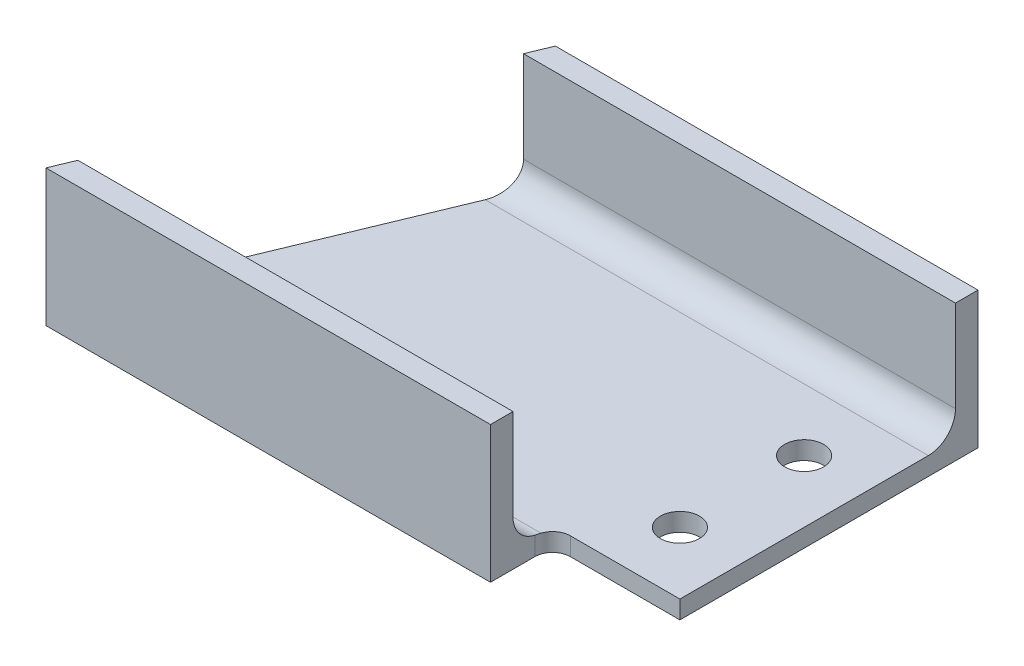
ISO-10303-21;
HEADER;
FILE_DESCRIPTION(('STEP AP214'),'2;1');
FILE_NAME('part.step','',(''),(''),'','','');
FILE_SCHEMA(('AUTOMOTIVE_DESIGN { 1 0 10303 214 1 1 1 1 }'));
ENDSEC;
DATA;
#1=APPLICATION_CONTEXT('core data for automotive mechanical design processes');
#2=APPLICATION_PROTOCOL_DEFINITION('international standard','automotive_design',2000,#1);
#3=PRODUCT_CONTEXT('',#1,'mechanical');
#4=PRODUCT('Part','Part','',(#3));
#5=PRODUCT_RELATED_PRODUCT_CATEGORY('part','',(#4));
#6=PRODUCT_DEFINITION_FORMATION('','',#4);
#7=PRODUCT_DEFINITION_CONTEXT('part definition',#1,'design');
#8=PRODUCT_DEFINITION('design','',#6,#7);
#9=PRODUCT_DEFINITION_SHAPE('','',#8);
#10=(LENGTH_UNIT() NAMED_UNIT(*) SI_UNIT(.MILLI.,.METRE.));
#11=(NAMED_UNIT(*) PLANE_ANGLE_UNIT() SI_UNIT($,.RADIAN.));
#12=(NAMED_UNIT(*) SI_UNIT($,.STERADIAN.) SOLID_ANGLE_UNIT());
#13=UNCERTAINTY_MEASURE_WITH_UNIT(LENGTH_MEASURE(1.E-05),#10,'distance_accuracy_value','');
#14=(GEOMETRIC_REPRESENTATION_CONTEXT(3) GLOBAL_UNCERTAINTY_ASSIGNED_CONTEXT((#13)) GLOBAL_UNIT_ASSIGNED_CONTEXT((#10,
#11,#12)) REPRESENTATION_CONTEXT('',''));
#15=CARTESIAN_POINT('',(0.,0.,0.));
#16=DIRECTION('',(0.,0.,1.));
#17=DIRECTION('',(1.,0.,0.));
#18=AXIS2_PLACEMENT_3D('',#15,#16,#17);
#19=CARTESIAN_POINT('',(345.,25.5000000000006,-175.));
#20=DIRECTION('',(-1.,0.,0.));
#21=DIRECTION('',(0.,0.,1.));
#22=AXIS2_PLACEMENT_3D('',#19,#20,#21);
#23=CYLINDRICAL_SURFACE('',#22,15.3);
#24=DIRECTION('',(-1.,0.,0.));
#25=VECTOR('',#24,1.);
#26=CARTESIAN_POINT('',(345.,10.2000000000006,-175.));
#27=LINE('',#26,#25);
#28=CARTESIAN_POINT('',(322.249999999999,10.2000000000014,-174.999999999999));
#29=VERTEX_POINT('',#28);
#30=CARTESIAN_POINT('',(72.4873734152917,10.2000000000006,-175.));
#31=VERTEX_POINT('',#30);
#32=EDGE_CURVE('E231',#29,#31,#27,.T.);
#33=ORIENTED_EDGE('',*,*,#32,.F.);
#34=CARTESIAN_POINT('',(322.249999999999,25.5000000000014,-174.999999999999));
#35=DIRECTION('',(1.,0.,0.));
#36=DIRECTION('',(0.,0.,-1.));
#37=AXIS2_PLACEMENT_3D('',#34,#35,#36);
#38=CIRCLE('',#37,15.3);
#39=CARTESIAN_POINT('',(322.249999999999,25.5000000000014,-190.299999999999));
#40=VERTEX_POINT('',#39);
#41=EDGE_CURVE('E318',#40,#29,#38,.F.);
#42=ORIENTED_EDGE('',*,*,#41,.F.);
#43=DIRECTION('',(-1.,0.,0.));
#44=VECTOR('',#43,1.);
#45=CARTESIAN_POINT('',(345.,25.5000000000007,-190.3));
#46=LINE('',#45,#44);
#47=CARTESIAN_POINT('',(78.8248409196,25.5000000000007,-190.3));
#48=VERTEX_POINT('',#47);
#49=EDGE_CURVE('E209',#40,#48,#46,.T.);
#50=ORIENTED_EDGE('',*,*,#49,.T.);
#51=CARTESIAN_POINT('',(72.4873734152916,25.5000000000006,-175.));
#52=DIRECTION('',(-0.923879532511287,0.,-0.38268343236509));
#53=DIRECTION('',(-0.38268343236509,0.,0.923879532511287));
#54=AXIS2_PLACEMENT_3D('',#51,#52,#53);
#55=ELLIPSE('',#54,16.5606006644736,15.3);
#56=EDGE_CURVE('E228',#48,#31,#55,.T.);
#57=ORIENTED_EDGE('',*,*,#56,.T.);
#58=EDGE_LOOP('',(#33,#42,#50,#57));
#59=FACE_BOUND('',#58,.T.);
#60=ADVANCED_FACE('F71',(#59),#23,.F.);
#61=CARTESIAN_POINT('',(345.,10.2000000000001,-28.));
#62=DIRECTION('',(0.,1.,0.));
#63=DIRECTION('',(0.,0.,1.));
#64=AXIS2_PLACEMENT_3D('',#61,#62,#63);
#65=PLANE('',#64);
#66=CARTESIAN_POINT('',(287.249999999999,10.2000000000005,-139.999999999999));
#67=DIRECTION('',(0.,1.,0.));
#68=DIRECTION('',(0.,0.,1.));
#69=AXIS2_PLACEMENT_3D('',#66,#67,#68);
#70=CIRCLE('',#69,11.);
#71=CARTESIAN_POINT('',(287.249999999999,10.2000000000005,-128.999999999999));
#72=VERTEX_POINT('',#71);
#73=EDGE_CURVE('E197',#72,#72,#70,.F.);
#74=ORIENTED_EDGE('',*,*,#73,.T.);
#75=EDGE_LOOP('',(#74));
#76=FACE_BOUND('',#75,.T.);
#77=CARTESIAN_POINT('',(287.249999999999,10.2000000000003,-69.9999999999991));
#78=DIRECTION('',(0.,1.,0.));
#79=DIRECTION('',(0.,0.,1.));
#80=AXIS2_PLACEMENT_3D('',#77,#78,#79);
#81=CIRCLE('',#80,11.);
#82=CARTESIAN_POINT('',(287.249999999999,10.2000000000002,-58.9999999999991));
#83=VERTEX_POINT('',#82);
#84=EDGE_CURVE('E206',#83,#83,#81,.F.);
#85=ORIENTED_EDGE('',*,*,#84,.T.);
#86=EDGE_LOOP('',(#85));
#87=FACE_BOUND('',#86,.T.);
#88=DIRECTION('',(-1.,0.,0.));
#89=VECTOR('',#88,1.);
#90=CARTESIAN_POINT('',(-55.000000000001,10.2000000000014,-34.999999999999));
#91=LINE('',#90,#89);
#92=CARTESIAN_POINT('',(322.249999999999,10.2000000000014,-34.9999999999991));
#93=VERTEX_POINT('',#92);
#94=CARTESIAN_POINT('',(260.499999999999,10.2000000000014,-34.9999999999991));
#95=VERTEX_POINT('',#94);
#96=EDGE_CURVE('E199',#93,#95,#91,.T.);
#97=ORIENTED_EDGE('',*,*,#96,.F.);
#98=DIRECTION('',(0.,0.,1.));
#99=VECTOR('',#98,1.);
#100=CARTESIAN_POINT('',(322.249999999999,10.2000000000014,-27.9999999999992));
#101=LINE('',#100,#99);
#102=EDGE_CURVE('E194',#29,#93,#101,.T.);
#103=ORIENTED_EDGE('',*,*,#102,.F.);
#104=ORIENTED_EDGE('',*,*,#32,.T.);
#105=DIRECTION('',(-0.38268343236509,0.,0.923879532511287));
#106=VECTOR('',#105,1.);
#107=CARTESIAN_POINT('',(60.4235751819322,10.2000000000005,-145.875414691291));
#108=LINE('',#107,#106);
#109=CARTESIAN_POINT('',(11.5979797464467,10.2000000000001,-28.));
#110=VERTEX_POINT('',#109);
#111=EDGE_CURVE('E232',#31,#110,#108,.T.);
#112=ORIENTED_EDGE('',*,*,#111,.T.);
#113=DIRECTION('',(-1.,0.,0.));
#114=VECTOR('',#113,1.);
#115=CARTESIAN_POINT('',(345.,10.2000000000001,-28.));
#116=LINE('',#115,#114);
#117=CARTESIAN_POINT('',(250.96060798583,10.2000000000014,-27.9999999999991));
#118=VERTEX_POINT('',#117);
#119=EDGE_CURVE('E235',#118,#110,#116,.T.);
#120=ORIENTED_EDGE('',*,*,#119,.F.);
#121=CARTESIAN_POINT('',(260.499999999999,10.2000000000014,-24.9999999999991));
#122=DIRECTION('',(0.,-1.,0.));
#123=DIRECTION('',(0.,0.,1.));
#124=AXIS2_PLACEMENT_3D('',#121,#122,#123);
#125=CIRCLE('',#124,10.);
#126=EDGE_CURVE('E184',#95,#118,#125,.F.);
#127=ORIENTED_EDGE('',*,*,#126,.F.);
#128=EDGE_LOOP('',(#97,#103,#104,#112,#120,#127));
#129=FACE_BOUND('',#128,.T.);
#130=ADVANCED_FACE('F275',(#76,#87,#129),#65,.T.);
#131=CARTESIAN_POINT('',(345.,25.5000000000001,-27.9999999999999));
#132=DIRECTION('',(-1.,0.,0.));
#133=DIRECTION('',(0.,0.,1.));
#134=AXIS2_PLACEMENT_3D('',#131,#132,#133);
#135=CYLINDRICAL_SURFACE('',#134,15.3);
#136=CARTESIAN_POINT('',(250.499999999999,10.4970002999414,-24.9999999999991));
#137=CARTESIAN_POINT('',(250.499998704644,10.4718419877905,-25.1258067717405));
#138=CARTESIAN_POINT('',(250.502374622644,10.4482731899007,-25.2519167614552));
#139=CARTESIAN_POINT('',(250.511935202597,10.4043390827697,-25.5045144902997));
#140=CARTESIAN_POINT('',(250.519119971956,10.3839738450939,-25.6310022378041));
#141=CARTESIAN_POINT('',(250.547807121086,10.3280371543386,-26.008551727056));
#142=CARTESIAN_POINT('',(250.576441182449,10.2972011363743,-26.2598237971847));
#143=CARTESIAN_POINT('',(250.652958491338,10.2482011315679,-26.7606666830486));
#144=CARTESIAN_POINT('',(250.700841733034,10.2300371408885,-27.010237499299));
#145=CARTESIAN_POINT('',(250.787160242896,10.2119466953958,-27.3826851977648));
#146=CARTESIAN_POINT('',(250.81851083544,10.2074431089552,-27.5070329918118));
#147=CARTESIAN_POINT('',(250.885989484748,10.20146895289,-27.7544964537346));
#148=CARTESIAN_POINT('',(250.922117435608,10.1999983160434,-27.8776121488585));
#149=CARTESIAN_POINT('',(250.96060798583,10.2000000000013,-27.9999999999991));
#150=B_SPLINE_CURVE_WITH_KNOTS('',3,(#136,#137,#138,#139,#140,#141,#142,#143,#144,#145,#146,
#147,#148,#149),.UNSPECIFIED.,.F.,.F.,(4,2,2,2,2,2,4),(0.,0.384830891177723,0.769670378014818,
1.53287587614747,2.29608114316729,2.68092063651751,3.06575160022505),.UNSPECIFIED.);
#151=CARTESIAN_POINT('',(250.499999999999,10.4970002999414,-24.9999999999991));
#152=VERTEX_POINT('',#151);
#153=EDGE_CURVE('E181',#152,#118,#150,.T.);
#154=ORIENTED_EDGE('',*,*,#153,.T.);
#155=ORIENTED_EDGE('',*,*,#119,.T.);
#156=CARTESIAN_POINT('',(11.5979797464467,25.5000000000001,-27.9999999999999));
#157=DIRECTION('',(-0.923879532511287,0.,-0.38268343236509));
#158=DIRECTION('',(-0.38268343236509,0.,0.923879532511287));
#159=AXIS2_PLACEMENT_3D('',#156,#157,#158);
#160=ELLIPSE('',#159,16.5606006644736,15.3);
#161=CARTESIAN_POINT('',(5.26051224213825,25.5,-12.6999999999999));
#162=VERTEX_POINT('',#161);
#163=EDGE_CURVE('E211',#162,#110,#160,.F.);
#164=ORIENTED_EDGE('',*,*,#163,.F.);
#165=DIRECTION('',(-1.,0.,0.));
#166=VECTOR('',#165,1.);
#167=CARTESIAN_POINT('',(345.,25.5,-12.6999999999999));
#168=LINE('',#167,#166);
#169=CARTESIAN_POINT('',(250.499999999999,25.5000000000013,-12.6999999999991));
#170=VERTEX_POINT('',#169);
#171=EDGE_CURVE('E193',#170,#162,#168,.T.);
#172=ORIENTED_EDGE('',*,*,#171,.F.);
#173=CARTESIAN_POINT('',(250.499999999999,25.5000000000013,-27.9999999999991));
#174=DIRECTION('',(1.,0.,0.));
#175=DIRECTION('',(0.,0.,-1.));
#176=AXIS2_PLACEMENT_3D('',#173,#174,#175);
#177=CIRCLE('',#176,15.3);
#178=EDGE_CURVE('E171',#170,#152,#177,.T.);
#179=ORIENTED_EDGE('',*,*,#178,.T.);
#180=EDGE_LOOP('',(#154,#155,#164,#172,#179));
#181=FACE_BOUND('',#180,.T.);
#182=ADVANCED_FACE('F191',(#181),#135,.F.);
#183=CARTESIAN_POINT('',(345.,77.,-12.6999999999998));
#184=DIRECTION('',(0.,0.,-1.));
#185=DIRECTION('',(0.,1.,0.));
#186=AXIS2_PLACEMENT_3D('',#183,#184,#185);
#187=PLANE('',#186);
#188=DIRECTION('',(-1.,0.,0.));
#189=VECTOR('',#188,1.);
#190=CARTESIAN_POINT('',(345.,77.,-12.6999999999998));
#191=LINE('',#190,#189);
#192=CARTESIAN_POINT('',(250.499999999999,77.0000000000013,-12.6999999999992));
#193=VERTEX_POINT('',#192);
#194=CARTESIAN_POINT('',(5.26051224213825,77.,-12.6999999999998));
#195=VERTEX_POINT('',#194);
#196=EDGE_CURVE('E241',#193,#195,#191,.T.);
#197=ORIENTED_EDGE('',*,*,#196,.F.);
#198=DIRECTION('',(0.,1.,0.));
#199=VECTOR('',#198,1.);
#200=CARTESIAN_POINT('',(250.499999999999,77.0000000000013,-12.6999999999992));
#201=LINE('',#200,#199);
#202=EDGE_CURVE('E291',#170,#193,#201,.T.);
#203=ORIENTED_EDGE('',*,*,#202,.F.);
#204=ORIENTED_EDGE('',*,*,#171,.T.);
#205=DIRECTION('',(0.,1.,0.));
#206=VECTOR('',#205,1.);
#207=CARTESIAN_POINT('',(5.26051224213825,76.9999999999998,-12.6999999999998));
#208=LINE('',#207,#206);
#209=EDGE_CURVE('E238',#162,#195,#208,.T.);
#210=ORIENTED_EDGE('',*,*,#209,.T.);
#211=EDGE_LOOP('',(#197,#203,#204,#210));
#212=FACE_BOUND('',#211,.T.);
#213=ADVANCED_FACE('F269',(#212),#187,.T.);
#214=CARTESIAN_POINT('',(345.,77.,2.63677968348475E-13));
#215=DIRECTION('',(0.,1.,0.));
#216=DIRECTION('',(0.,0.,1.));
#217=AXIS2_PLACEMENT_3D('',#214,#215,#216);
#218=PLANE('',#217);
#219=DIRECTION('',(-1.,0.,0.));
#220=VECTOR('',#219,1.);
#221=CARTESIAN_POINT('',(345.,77.,2.63677968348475E-13));
#222=LINE('',#221,#220);
#223=CARTESIAN_POINT('',(250.499999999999,77.,2.63677968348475E-13));
#224=VERTEX_POINT('',#223);
#225=CARTESIAN_POINT('',(0.,77.0000000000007,0.));
#226=VERTEX_POINT('',#225);
#227=EDGE_CURVE('E95',#224,#226,#222,.T.);
#228=ORIENTED_EDGE('',*,*,#227,.F.);
#229=DIRECTION('',(0.,0.,1.));
#230=VECTOR('',#229,1.);
#231=CARTESIAN_POINT('',(250.499999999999,77.0000000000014,8.33780790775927E-13));
#232=LINE('',#231,#230);
#233=EDGE_CURVE('E88',#193,#224,#232,.T.);
#234=ORIENTED_EDGE('',*,*,#233,.F.);
#235=ORIENTED_EDGE('',*,*,#196,.T.);
#236=DIRECTION('',(-0.38268343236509,0.,0.923879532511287));
#237=VECTOR('',#236,1.);
#238=CARTESIAN_POINT('',(50.5240802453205,77.0000000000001,-121.975919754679));
#239=LINE('',#238,#237);
#240=EDGE_CURVE('E215',#195,#226,#239,.T.);
#241=ORIENTED_EDGE('',*,*,#240,.T.);
#242=EDGE_LOOP('',(#228,#234,#235,#241));
#243=FACE_BOUND('',#242,.T.);
#244=ADVANCED_FACE('F259',(#243),#218,.T.);
#245=CARTESIAN_POINT('',(345.,0.,0.));
#246=DIRECTION('',(0.,1.,0.));
#247=DIRECTION('',(0.,0.,1.));
#248=AXIS2_PLACEMENT_3D('',#245,#246,#247);
#249=PLANE('',#248);
#250=DIRECTION('',(0.,0.,1.));
#251=VECTOR('',#250,1.);
#252=CARTESIAN_POINT('',(322.249999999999,1.33226762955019E-12,8.39467826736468E-13));
#253=LINE('',#252,#251);
#254=CARTESIAN_POINT('',(322.249999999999,1.38141408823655E-12,-202.999999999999));
#255=VERTEX_POINT('',#254);
#256=CARTESIAN_POINT('',(322.249999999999,1.3365538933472E-12,-34.9999999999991));
#257=VERTEX_POINT('',#256);
#258=EDGE_CURVE('E297',#255,#257,#253,.T.);
#259=ORIENTED_EDGE('',*,*,#258,.T.);
#260=DIRECTION('',(-1.,0.,0.));
#261=VECTOR('',#260,1.);
#262=CARTESIAN_POINT('',(-55.0000000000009,1.34074115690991E-12,-34.999999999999));
#263=LINE('',#262,#261);
#264=CARTESIAN_POINT('',(260.499999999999,1.3365538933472E-12,-34.9999999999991));
#265=VERTEX_POINT('',#264);
#266=EDGE_CURVE('E316',#257,#265,#263,.T.);
#267=ORIENTED_EDGE('',*,*,#266,.T.);
#268=CARTESIAN_POINT('',(260.499999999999,1.33532924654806E-12,-24.9999999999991));
#269=DIRECTION('',(0.,-1.,0.));
#270=DIRECTION('',(0.,0.,1.));
#271=AXIS2_PLACEMENT_3D('',#268,#269,#270);
#272=CIRCLE('',#271,10.);
#273=CARTESIAN_POINT('',(250.499999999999,1.33532924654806E-12,-24.9999999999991));
#274=VERTEX_POINT('',#273);
#275=EDGE_CURVE('E187',#265,#274,#272,.F.);
#276=ORIENTED_EDGE('',*,*,#275,.T.);
#277=DIRECTION('',(0.,0.,1.));
#278=VECTOR('',#277,1.);
#279=CARTESIAN_POINT('',(250.499999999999,1.33226762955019E-12,8.20076651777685E-13));
#280=LINE('',#279,#278);
#281=CARTESIAN_POINT('',(250.499999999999,1.33226762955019E-12,8.76605507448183E-13));
#282=VERTEX_POINT('',#281);
#283=EDGE_CURVE('E174',#274,#282,#280,.T.);
#284=ORIENTED_EDGE('',*,*,#283,.T.);
#285=DIRECTION('',(-1.,0.,0.));
#286=VECTOR('',#285,1.);
#287=CARTESIAN_POINT('',(345.,0.,0.));
#288=LINE('',#287,#286);
#289=CARTESIAN_POINT('',(0.,0.,0.));
#290=VERTEX_POINT('',#289);
#291=EDGE_CURVE('E213',#282,#290,#288,.T.);
#292=ORIENTED_EDGE('',*,*,#291,.T.);
#293=DIRECTION('',(-0.38268343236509,0.,0.923879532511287));
#294=VECTOR('',#293,1.);
#295=CARTESIAN_POINT('',(50.5240802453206,4.3699992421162E-13,-121.975919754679));
#296=LINE('',#295,#294);
#297=CARTESIAN_POINT('',(84.0853531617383,7.28583859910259E-13,-203.));
#298=VERTEX_POINT('',#297);
#299=EDGE_CURVE('E80',#298,#290,#296,.T.);
#300=ORIENTED_EDGE('',*,*,#299,.F.);
#301=DIRECTION('',(-1.,0.,0.));
#302=VECTOR('',#301,1.);
#303=CARTESIAN_POINT('',(345.,7.28583859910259E-13,-203.));
#304=LINE('',#303,#302);
#305=EDGE_CURVE('E214',#255,#298,#304,.T.);
#306=ORIENTED_EDGE('',*,*,#305,.F.);
#307=EDGE_LOOP('',(#259,#267,#276,#284,#292,#300,#306));
#308=FACE_BOUND('',#307,.T.);
#309=CARTESIAN_POINT('',(287.249999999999,4.9960036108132E-13,-139.999999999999));
#310=DIRECTION('',(0.,1.,0.));
#311=DIRECTION('',(0.,0.,1.));
#312=AXIS2_PLACEMENT_3D('',#309,#310,#311);
#313=CIRCLE('',#312,11.);
#314=CARTESIAN_POINT('',(287.249999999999,4.59878069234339E-13,-128.999999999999));
#315=VERTEX_POINT('',#314);
#316=EDGE_CURVE('E75',#315,#315,#313,.F.);
#317=ORIENTED_EDGE('',*,*,#316,.F.);
#318=EDGE_LOOP('',(#317));
#319=FACE_BOUND('',#318,.T.);
#320=CARTESIAN_POINT('',(287.249999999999,2.4980018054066E-13,-69.9999999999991));
#321=DIRECTION('',(0.,1.,0.));
#322=DIRECTION('',(0.,0.,1.));
#323=AXIS2_PLACEMENT_3D('',#320,#321,#322);
#324=CIRCLE('',#323,11.);
#325=CARTESIAN_POINT('',(287.249999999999,2.10077888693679E-13,-58.9999999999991));
#326=VERTEX_POINT('',#325);
#327=EDGE_CURVE('E205',#326,#326,#324,.F.);
#328=ORIENTED_EDGE('',*,*,#327,.F.);
#329=EDGE_LOOP('',(#328));
#330=FACE_BOUND('',#329,.T.);
#331=ADVANCED_FACE('F256',(#308,#319,#330),#249,.F.);
#332=CARTESIAN_POINT('',(345.,7.28583859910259E-13,-203.));
#333=DIRECTION('',(0.,0.,1.));
#334=DIRECTION('',(0.,-1.,0.));
#335=AXIS2_PLACEMENT_3D('',#332,#333,#334);
#336=PLANE('',#335);
#337=DIRECTION('',(0.,-1.,0.));
#338=VECTOR('',#337,1.);
#339=CARTESIAN_POINT('',(322.249999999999,1.38141408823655E-12,-202.999999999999));
#340=LINE('',#339,#338);
#341=CARTESIAN_POINT('',(322.249999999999,77.0000000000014,-202.999999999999));
#342=VERTEX_POINT('',#341);
#343=EDGE_CURVE('E334',#342,#255,#340,.T.);
#344=ORIENTED_EDGE('',*,*,#343,.T.);
#345=ORIENTED_EDGE('',*,*,#305,.T.);
#346=DIRECTION('',(0.,-1.,0.));
#347=VECTOR('',#346,1.);
#348=CARTESIAN_POINT('',(84.0853531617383,3.47001990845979E-13,-203.));
#349=LINE('',#348,#347);
#350=CARTESIAN_POINT('',(84.0853531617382,77.0000000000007,-203.));
#351=VERTEX_POINT('',#350);
#352=EDGE_CURVE('E219',#351,#298,#349,.T.);
#353=ORIENTED_EDGE('',*,*,#352,.F.);
#354=DIRECTION('',(-1.,0.,0.));
#355=VECTOR('',#354,1.);
#356=CARTESIAN_POINT('',(345.,77.0000000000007,-203.));
#357=LINE('',#356,#355);
#358=EDGE_CURVE('E248',#342,#351,#357,.T.);
#359=ORIENTED_EDGE('',*,*,#358,.F.);
#360=EDGE_LOOP('',(#344,#345,#353,#359));
#361=FACE_BOUND('',#360,.T.);
#362=ADVANCED_FACE('F258',(#361),#336,.F.);
#363=CARTESIAN_POINT('',(345.,77.0000000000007,-203.));
#364=DIRECTION('',(0.,-1.,0.));
#365=DIRECTION('',(0.,0.,-1.));
#366=AXIS2_PLACEMENT_3D('',#363,#364,#365);
#367=PLANE('',#366);
#368=DIRECTION('',(0.,0.,-1.));
#369=VECTOR('',#368,1.);
#370=CARTESIAN_POINT('',(322.249999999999,77.0000000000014,-202.999999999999));
#371=LINE('',#370,#369);
#372=CARTESIAN_POINT('',(322.249999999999,77.0000000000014,-190.299999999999));
#373=VERTEX_POINT('',#372);
#374=EDGE_CURVE('E331',#373,#342,#371,.T.);
#375=ORIENTED_EDGE('',*,*,#374,.T.);
#376=ORIENTED_EDGE('',*,*,#358,.T.);
#377=DIRECTION('',(0.38268343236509,0.,-0.923879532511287));
#378=VECTOR('',#377,1.);
#379=CARTESIAN_POINT('',(122.295418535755,77.0000000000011,-295.247258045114));
#380=LINE('',#379,#378);
#381=CARTESIAN_POINT('',(78.8248409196,77.0000000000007,-190.3));
#382=VERTEX_POINT('',#381);
#383=EDGE_CURVE('E222',#382,#351,#380,.T.);
#384=ORIENTED_EDGE('',*,*,#383,.F.);
#385=DIRECTION('',(-1.,0.,0.));
#386=VECTOR('',#385,1.);
#387=CARTESIAN_POINT('',(345.,77.0000000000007,-190.3));
#388=LINE('',#387,#386);
#389=EDGE_CURVE('E212',#373,#382,#388,.T.);
#390=ORIENTED_EDGE('',*,*,#389,.F.);
#391=EDGE_LOOP('',(#375,#376,#384,#390));
#392=FACE_BOUND('',#391,.T.);
#393=ADVANCED_FACE('F266',(#392),#367,.F.);
#394=CARTESIAN_POINT('',(345.,77.0000000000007,-190.3));
#395=DIRECTION('',(0.,0.,-1.));
#396=DIRECTION('',(0.,1.,0.));
#397=AXIS2_PLACEMENT_3D('',#394,#395,#396);
#398=PLANE('',#397);
#399=DIRECTION('',(0.,1.,0.));
#400=VECTOR('',#399,1.);
#401=CARTESIAN_POINT('',(322.249999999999,77.0000000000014,-190.299999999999));
#402=LINE('',#401,#400);
#403=EDGE_CURVE('E328',#40,#373,#402,.T.);
#404=ORIENTED_EDGE('',*,*,#403,.T.);
#405=ORIENTED_EDGE('',*,*,#389,.T.);
#406=DIRECTION('',(0.,1.,0.));
#407=VECTOR('',#406,1.);
#408=CARTESIAN_POINT('',(78.8248409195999,77.0000000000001,-190.3));
#409=LINE('',#408,#407);
#410=EDGE_CURVE('E225',#48,#382,#409,.T.);
#411=ORIENTED_EDGE('',*,*,#410,.F.);
#412=ORIENTED_EDGE('',*,*,#49,.F.);
#413=EDGE_LOOP('',(#404,#405,#411,#412));
#414=FACE_BOUND('',#413,.T.);
#415=ADVANCED_FACE('F346',(#414),#398,.F.);
#416=CARTESIAN_POINT('',(345.,0.,0.));
#417=DIRECTION('',(0.,0.,1.));
#418=DIRECTION('',(0.,-1.,0.));
#419=AXIS2_PLACEMENT_3D('',#416,#417,#418);
#420=PLANE('',#419);
#421=ORIENTED_EDGE('',*,*,#291,.F.);
#422=DIRECTION('',(0.,-1.,0.));
#423=VECTOR('',#422,1.);
#424=CARTESIAN_POINT('',(250.499999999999,1.33226762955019E-12,8.76605507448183E-13));
#425=LINE('',#424,#423);
#426=EDGE_CURVE('E294',#224,#282,#425,.T.);
#427=ORIENTED_EDGE('',*,*,#426,.F.);
#428=ORIENTED_EDGE('',*,*,#227,.T.);
#429=DIRECTION('',(0.,1.,0.));
#430=VECTOR('',#429,1.);
#431=CARTESIAN_POINT('',(0.,25.5000000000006,0.));
#432=LINE('',#431,#430);
#433=EDGE_CURVE('E13',#290,#226,#432,.T.);
#434=ORIENTED_EDGE('',*,*,#433,.F.);
#435=EDGE_LOOP('',(#421,#427,#428,#434));
#436=FACE_BOUND('',#435,.T.);
#437=ADVANCED_FACE('F313',(#436),#420,.T.);
#438=CARTESIAN_POINT('',(0.,0.,0.));
#439=DIRECTION('',(-0.923879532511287,0.,-0.38268343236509));
#440=DIRECTION('',(-0.38268343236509,0.,0.923879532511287));
#441=AXIS2_PLACEMENT_3D('',#438,#439,#440);
#442=PLANE('',#441);
#443=ORIENTED_EDGE('',*,*,#240,.F.);
#444=ORIENTED_EDGE('',*,*,#209,.F.);
#445=ORIENTED_EDGE('',*,*,#163,.T.);
#446=ORIENTED_EDGE('',*,*,#111,.F.);
#447=ORIENTED_EDGE('',*,*,#56,.F.);
#448=ORIENTED_EDGE('',*,*,#410,.T.);
#449=ORIENTED_EDGE('',*,*,#383,.T.);
#450=ORIENTED_EDGE('',*,*,#352,.T.);
#451=ORIENTED_EDGE('',*,*,#299,.T.);
#452=ORIENTED_EDGE('',*,*,#433,.T.);
#453=EDGE_LOOP('',(#443,#444,#445,#446,#447,#448,#449,#450,#451,#452));
#454=FACE_BOUND('',#453,.T.);
#455=ADVANCED_FACE('F73',(#454),#442,.T.);
#456=CARTESIAN_POINT('',(287.249999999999,-77.7999999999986,-69.9999999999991));
#457=DIRECTION('',(0.,1.,0.));
#458=DIRECTION('',(-1.,0.,0.));
#459=AXIS2_PLACEMENT_3D('',#456,#457,#458);
#460=CYLINDRICAL_SURFACE('',#459,11.);
#461=ORIENTED_EDGE('',*,*,#84,.F.);
#462=EDGE_LOOP('',(#461));
#463=FACE_BOUND('',#462,.T.);
#464=ORIENTED_EDGE('',*,*,#327,.T.);
#465=EDGE_LOOP('',(#464));
#466=FACE_BOUND('',#465,.T.);
#467=ADVANCED_FACE('F254',(#463,#466),#460,.F.);
#468=CARTESIAN_POINT('',(287.249999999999,-77.7999999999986,-139.999999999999));
#469=DIRECTION('',(0.,1.,0.));
#470=DIRECTION('',(-1.,0.,0.));
#471=AXIS2_PLACEMENT_3D('',#468,#469,#470);
#472=CYLINDRICAL_SURFACE('',#471,11.);
#473=ORIENTED_EDGE('',*,*,#73,.F.);
#474=EDGE_LOOP('',(#473));
#475=FACE_BOUND('',#474,.T.);
#476=ORIENTED_EDGE('',*,*,#316,.T.);
#477=EDGE_LOOP('',(#476));
#478=FACE_BOUND('',#477,.T.);
#479=ADVANCED_FACE('F360',(#475,#478),#472,.F.);
#480=CARTESIAN_POINT('',(260.499999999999,150.000000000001,-34.999999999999));
#481=DIRECTION('',(0.,0.,1.));
#482=DIRECTION('',(1.,0.,0.));
#483=AXIS2_PLACEMENT_3D('',#480,#481,#482);
#484=PLANE('',#483);
#485=ORIENTED_EDGE('',*,*,#266,.F.);
#486=DIRECTION('',(0.,-1.,0.));
#487=VECTOR('',#486,1.);
#488=CARTESIAN_POINT('',(322.249999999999,150.000000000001,-34.999999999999));
#489=LINE('',#488,#487);
#490=EDGE_CURVE('E188',#93,#257,#489,.T.);
#491=ORIENTED_EDGE('',*,*,#490,.F.);
#492=ORIENTED_EDGE('',*,*,#96,.T.);
#493=DIRECTION('',(0.,-1.,0.));
#494=VECTOR('',#493,1.);
#495=CARTESIAN_POINT('',(260.499999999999,150.000000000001,-34.999999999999));
#496=LINE('',#495,#494);
#497=EDGE_CURVE('E178',#95,#265,#496,.T.);
#498=ORIENTED_EDGE('',*,*,#497,.T.);
#499=EDGE_LOOP('',(#485,#491,#492,#498));
#500=FACE_BOUND('',#499,.T.);
#501=ADVANCED_FACE('F306',(#500),#484,.T.);
#502=CARTESIAN_POINT('',(322.249999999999,150.000000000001,-34.999999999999));
#503=DIRECTION('',(1.,0.,0.));
#504=DIRECTION('',(0.,0.,-1.));
#505=AXIS2_PLACEMENT_3D('',#502,#503,#504);
#506=PLANE('',#505);
#507=ORIENTED_EDGE('',*,*,#258,.F.);
#508=ORIENTED_EDGE('',*,*,#343,.F.);
#509=ORIENTED_EDGE('',*,*,#374,.F.);
#510=ORIENTED_EDGE('',*,*,#403,.F.);
#511=ORIENTED_EDGE('',*,*,#41,.T.);
#512=ORIENTED_EDGE('',*,*,#102,.T.);
#513=ORIENTED_EDGE('',*,*,#490,.T.);
#514=EDGE_LOOP('',(#507,#508,#509,#510,#511,#512,#513));
#515=FACE_BOUND('',#514,.T.);
#516=ADVANCED_FACE('F337',(#515),#506,.T.);
#517=CARTESIAN_POINT('',(260.499999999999,150.000000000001,-24.999999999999));
#518=DIRECTION('',(0.,-1.,0.));
#519=DIRECTION('',(1.,0.,0.));
#520=AXIS2_PLACEMENT_3D('',#517,#518,#519);
#521=CYLINDRICAL_SURFACE('',#520,10.);
#522=ORIENTED_EDGE('',*,*,#275,.F.);
#523=ORIENTED_EDGE('',*,*,#497,.F.);
#524=ORIENTED_EDGE('',*,*,#126,.T.);
#525=ORIENTED_EDGE('',*,*,#153,.F.);
#526=DIRECTION('',(0.,-1.,0.));
#527=VECTOR('',#526,1.);
#528=CARTESIAN_POINT('',(250.499999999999,150.000000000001,-24.999999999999));
#529=LINE('',#528,#527);
#530=EDGE_CURVE('E167',#152,#274,#529,.T.);
#531=ORIENTED_EDGE('',*,*,#530,.T.);
#532=EDGE_LOOP('',(#522,#523,#524,#525,#531));
#533=FACE_BOUND('',#532,.T.);
#534=ADVANCED_FACE('F182',(#533),#521,.F.);
#535=CARTESIAN_POINT('',(250.499999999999,150.000000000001,200.000000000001));
#536=DIRECTION('',(1.,0.,0.));
#537=DIRECTION('',(0.,0.,-1.));
#538=AXIS2_PLACEMENT_3D('',#535,#536,#537);
#539=PLANE('',#538);
#540=ORIENTED_EDGE('',*,*,#283,.F.);
#541=ORIENTED_EDGE('',*,*,#530,.F.);
#542=ORIENTED_EDGE('',*,*,#178,.F.);
#543=ORIENTED_EDGE('',*,*,#202,.T.);
#544=ORIENTED_EDGE('',*,*,#233,.T.);
#545=ORIENTED_EDGE('',*,*,#426,.T.);
#546=EDGE_LOOP('',(#540,#541,#542,#543,#544,#545));
#547=FACE_BOUND('',#546,.T.);
#548=ADVANCED_FACE('F169',(#547),#539,.T.);
#549=CLOSED_SHELL('',(#60,#130,#182,#213,#244,#331,#362,#393,#415,#437,#455,#467,#479,#501,#516,
#534,#548));
#550=MANIFOLD_SOLID_BREP('B2',#549);
#551=ADVANCED_BREP_SHAPE_REPRESENTATION('',(#18,#550),#14);
#552=SHAPE_DEFINITION_REPRESENTATION(#9,#551);
ENDSEC;
END-ISO-10303-21;
